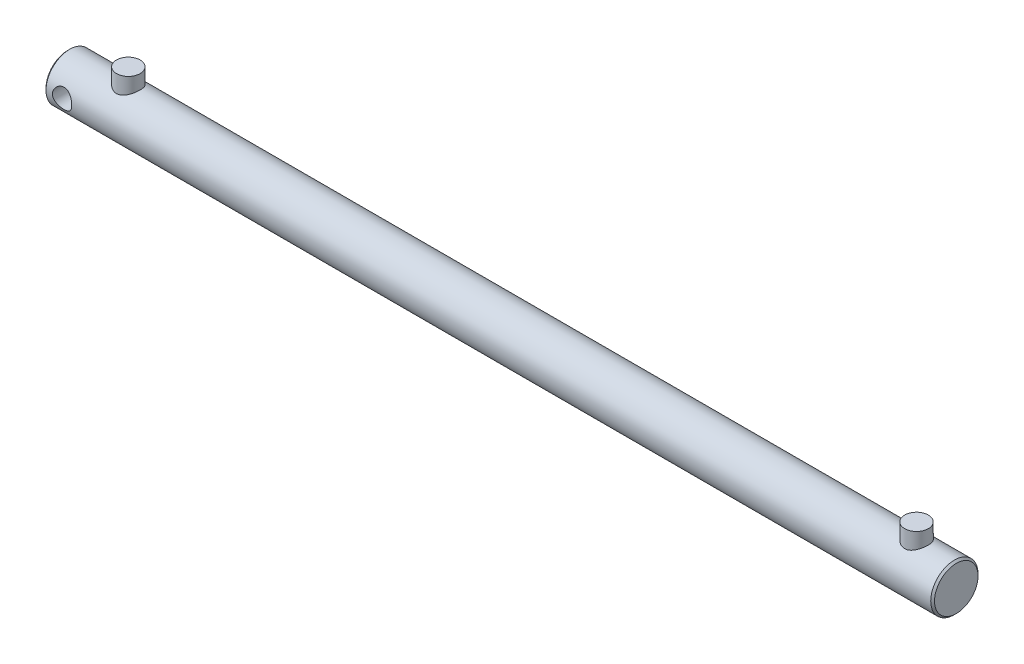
from build123d import *

# Parameters (mm, degrees)
ESQUISSE1_W                  = 939
ESQUISSE1_H                  = 25
CHANFREIN1_SIZE              = 2
ENL_V_MAT_EXTRU_1_DEPTH      = 471.829321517
ENL_V_MAT_EXTRU_1_DEPTH_BACK = 471.829321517
ESQUISSE3_R                  = 10.2
ESQUISSE5_R                  = 12.5
EXTRUSION2_DEPTH             = 40


with BuildPart() as part:
    # Esquisse1 → R_volution1 (revolve)
    with BuildSketch(Plane.XY, mode=Mode.PRIVATE) as r_volution1_sk:
        with Locations((0, 12.5)):
            Rectangle(ESQUISSE1_W, ESQUISSE1_H)
    revolve(r_volution1_sk.sketch.rotate(Axis((-469.5, 0, 0), (1, 0, 0)), 90), axis=Axis((-469.5, 0, 0), (1, 0, 0)))

    # Chanfrein1
    chanfrein1_edges = [part.edges().sort_by_distance(p)[0] for p in [
        (469.5, 0, -25),
        (-469.5, 0, -25),
    ]]
    chamfer(chanfrein1_edges, length=CHANFREIN1_SIZE)

    # Esquisse3 → Enl_v. mat.-Extru.1 (cut, two sides: drawn at the far end of the back side and taken through both)
    with BuildSketch(Plane.XY.offset(-ENL_V_MAT_EXTRU_1_DEPTH_BACK)):
        with Locations((-450.5, 0)):
            Circle(ESQUISSE3_R)
    extrude(amount=ENL_V_MAT_EXTRU_1_DEPTH + ENL_V_MAT_EXTRU_1_DEPTH_BACK, mode=Mode.SUBTRACT)

    # Esquisse5 → Extrusion2 (add)
    with BuildSketch(Plane(origin=(0, 0, 0), x_dir=(1, 0, 0), z_dir=(0, 1, 0))):
        with Locations(Location((-405.5, 0, 0), (0, 0, 90))):
            Circle(ESQUISSE5_R)
        with Locations(Location((427.5, 0, 0), (0, 0, 90))):
            Circle(ESQUISSE5_R)
    extrude(amount=EXTRUSION2_DEPTH)


solid = part.part
